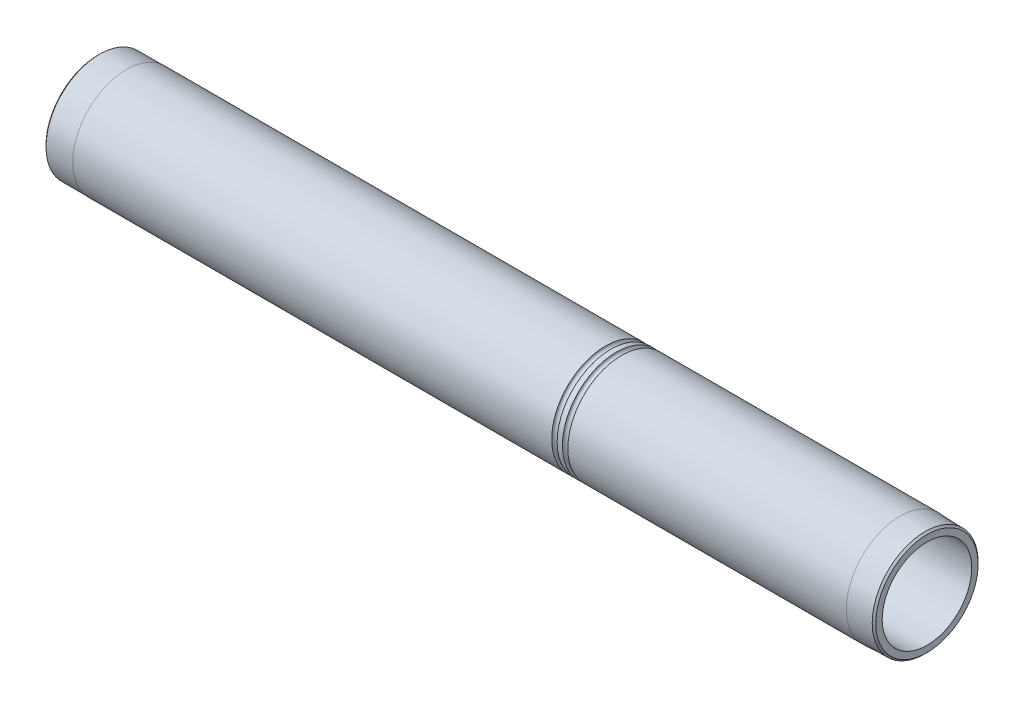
from build123d import *

# Parameters (mm, degrees)
SKETCH_27_W = 3.2
SKETCH_27_H = 26.75


with BuildPart() as part:
    # Sketch 1 → Revolve 1 (revolve)
    with BuildSketch(Plane.XY, mode=Mode.PRIVATE) as revolve_1_sk:
        Polygon((1, 30), (613, 30), (627, 29.565413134), (628, 28.565413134), (628, 25), (32, 25), (32, 25.35), (7, 25.35), (7, 26.85), (1.5, 26.85), (1.5, 25.85), (0.5, 25.85), (0, 26.35), (0, 29), align=None)
    revolve(revolve_1_sk.sketch.rotate(Axis((0, 0, 0), (1, 0, 0)), 90), axis=Axis((0, 0, 0), (1, 0, 0)))

    # Sketch 2 → Cut-Revolve 1 (revolve, cut)
    with BuildSketch(Plane.XY, mode=Mode.PRIVATE) as cut_revolve_1_sk:
        with BuildLine():
            Line((448.5, 29.975), (448.5, 31.475))
            Line((448.5, 31.475), (451.5, 31.475))
            Line((451.5, 31.475), (451.5, 29.975))
            ThreePointArc((451.5, 29.975), (450, 28.475), (448.5, 29.975))
        make_face()
        with BuildLine():
            Line((454.5, 31.475), (457.5, 31.475))
            Line((457.5, 31.475), (457.5, 29.975))
            ThreePointArc((457.5, 29.975), (456, 28.475), (454.5, 29.975))
            Line((454.5, 29.975), (454.5, 31.475))
        make_face()
    revolve(cut_revolve_1_sk.sketch.rotate(Axis((444, 0, 0), (1, 0, 0)), 90), axis=Axis((444, 0, 0), (1, 0, 0)), mode=Mode.SUBTRACT)

    # Sketch 10 → Cut-Revolve 2 (revolve, cut)
    with BuildSketch(Plane.XY, mode=Mode.PRIVATE) as cut_revolve_2_sk:
        Polygon((0, 0), (165, 0), (165, 28.9), (166, 29.9), (181, 29.9), (181, 39.9), (0, 39.9), align=None)
    revolve(cut_revolve_2_sk.sketch.rotate(Axis((0, 0, 0), (1, 0, 0)), 90), axis=Axis((0, 0, 0), (1, 0, 0)), mode=Mode.SUBTRACT)

    # Sketch 27 → Cut-Revolve 5 (revolve, cut)
    with BuildSketch(Plane.XY, mode=Mode.PRIVATE) as cut_revolve_5_sk:
        with Locations((213.4, 13.375)):
            Rectangle(SKETCH_27_W, SKETCH_27_H)
    revolve(cut_revolve_5_sk.sketch.rotate(Axis((211.8, 0, 0), (1, 0, 0)), 90), axis=Axis((211.8, 0, 0), (1, 0, 0)), mode=Mode.SUBTRACT)


solid = part.part
